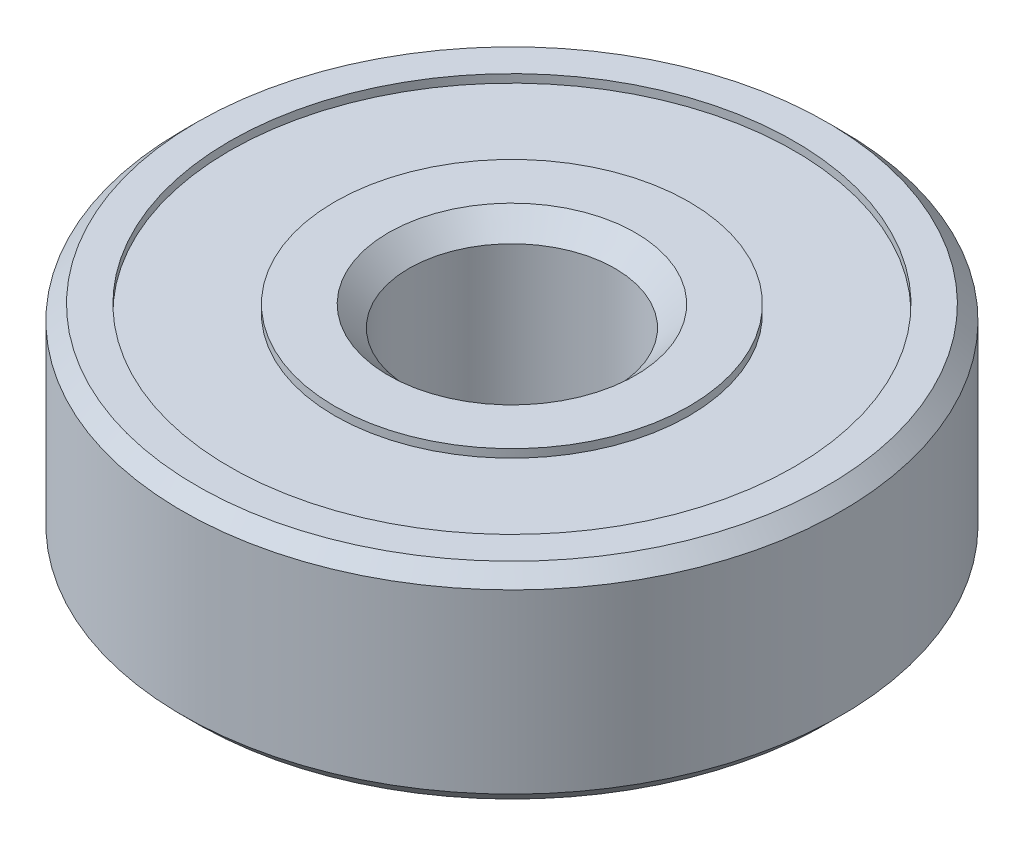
ISO-10303-21;
HEADER;
FILE_DESCRIPTION(('STEP AP214'),'2;1');
FILE_NAME('part.step','',(''),(''),'','','');
FILE_SCHEMA(('AUTOMOTIVE_DESIGN { 1 0 10303 214 1 1 1 1 }'));
ENDSEC;
DATA;
#1=APPLICATION_CONTEXT('core data for automotive mechanical design processes');
#2=APPLICATION_PROTOCOL_DEFINITION('international standard','automotive_design',2000,#1);
#3=PRODUCT_CONTEXT('',#1,'mechanical');
#4=PRODUCT('Part','Part','',(#3));
#5=PRODUCT_RELATED_PRODUCT_CATEGORY('part','',(#4));
#6=PRODUCT_DEFINITION_FORMATION('','',#4);
#7=PRODUCT_DEFINITION_CONTEXT('part definition',#1,'design');
#8=PRODUCT_DEFINITION('design','',#6,#7);
#9=PRODUCT_DEFINITION_SHAPE('','',#8);
#10=(LENGTH_UNIT() NAMED_UNIT(*) SI_UNIT(.MILLI.,.METRE.));
#11=(NAMED_UNIT(*) PLANE_ANGLE_UNIT() SI_UNIT($,.RADIAN.));
#12=(NAMED_UNIT(*) SI_UNIT($,.STERADIAN.) SOLID_ANGLE_UNIT());
#13=UNCERTAINTY_MEASURE_WITH_UNIT(LENGTH_MEASURE(1.E-05),#10,'distance_accuracy_value','');
#14=(GEOMETRIC_REPRESENTATION_CONTEXT(3) GLOBAL_UNCERTAINTY_ASSIGNED_CONTEXT((#13)) GLOBAL_UNIT_ASSIGNED_CONTEXT((#10,
#11,#12)) REPRESENTATION_CONTEXT('',''));
#15=CARTESIAN_POINT('',(0.,0.,0.));
#16=DIRECTION('',(0.,0.,1.));
#17=DIRECTION('',(1.,0.,0.));
#18=AXIS2_PLACEMENT_3D('',#15,#16,#17);
#19=CARTESIAN_POINT('',(0.,-2.32325,0.));
#20=DIRECTION('',(0.,1.,0.));
#21=DIRECTION('',(-1.,0.,0.));
#22=AXIS2_PLACEMENT_3D('',#19,#20,#21);
#23=CONICAL_SURFACE('',#22,7.82325,0.785398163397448);
#24=CARTESIAN_POINT('',(0.,-2.5,0.));
#25=DIRECTION('',(0.,1.,0.));
#26=DIRECTION('',(-1.,0.,0.));
#27=AXIS2_PLACEMENT_3D('',#24,#25,#26);
#28=CIRCLE('',#27,7.6465);
#29=CARTESIAN_POINT('',(-7.6465,-2.5,0.));
#30=VERTEX_POINT('',#29);
#31=EDGE_CURVE('E11',#30,#30,#28,.T.);
#32=ORIENTED_EDGE('',*,*,#31,.T.);
#33=EDGE_LOOP('',(#32));
#34=FACE_BOUND('',#33,.T.);
#35=CARTESIAN_POINT('',(0.,-2.1465,0.));
#36=DIRECTION('',(0.,1.,0.));
#37=DIRECTION('',(-1.,0.,0.));
#38=AXIS2_PLACEMENT_3D('',#35,#36,#37);
#39=CIRCLE('',#38,8.);
#40=CARTESIAN_POINT('',(-8.,-2.1465,0.));
#41=VERTEX_POINT('',#40);
#42=EDGE_CURVE('E100',#41,#41,#39,.T.);
#43=ORIENTED_EDGE('',*,*,#42,.F.);
#44=EDGE_LOOP('',(#43));
#45=FACE_BOUND('',#44,.T.);
#46=ADVANCED_FACE('F16',(#34,#45),#23,.T.);
#47=CARTESIAN_POINT('',(-7.24825,-2.5,0.));
#48=DIRECTION('',(0.,-1.,0.));
#49=DIRECTION('',(0.707106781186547,0.,0.707106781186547));
#50=AXIS2_PLACEMENT_3D('',#47,#48,#49);
#51=PLANE('',#50);
#52=CARTESIAN_POINT('',(0.,-2.5,0.));
#53=DIRECTION('',(0.,1.,0.));
#54=DIRECTION('',(-1.,0.,0.));
#55=AXIS2_PLACEMENT_3D('',#52,#53,#54);
#56=CIRCLE('',#55,6.85);
#57=CARTESIAN_POINT('',(-6.85,-2.5,0.));
#58=VERTEX_POINT('',#57);
#59=EDGE_CURVE('E26',#58,#58,#56,.T.);
#60=ORIENTED_EDGE('',*,*,#59,.T.);
#61=EDGE_LOOP('',(#60));
#62=FACE_BOUND('',#61,.T.);
#63=ORIENTED_EDGE('',*,*,#31,.F.);
#64=EDGE_LOOP('',(#63));
#65=FACE_BOUND('',#64,.T.);
#66=ADVANCED_FACE('F124',(#62,#65),#51,.T.);
#67=CARTESIAN_POINT('',(0.,-2.4,0.));
#68=DIRECTION('',(0.,-1.,0.));
#69=DIRECTION('',(-1.,0.,0.));
#70=AXIS2_PLACEMENT_3D('',#67,#68,#69);
#71=CYLINDRICAL_SURFACE('',#70,6.85);
#72=CARTESIAN_POINT('',(0.,-2.3,0.));
#73=DIRECTION('',(0.,1.,0.));
#74=DIRECTION('',(-1.,0.,0.));
#75=AXIS2_PLACEMENT_3D('',#72,#73,#74);
#76=CIRCLE('',#75,6.85);
#77=CARTESIAN_POINT('',(-6.85,-2.3,0.));
#78=VERTEX_POINT('',#77);
#79=EDGE_CURVE('E113',#78,#78,#76,.T.);
#80=ORIENTED_EDGE('',*,*,#79,.T.);
#81=EDGE_LOOP('',(#80));
#82=FACE_BOUND('',#81,.T.);
#83=ORIENTED_EDGE('',*,*,#59,.F.);
#84=EDGE_LOOP('',(#83));
#85=FACE_BOUND('',#84,.T.);
#86=ADVANCED_FACE('F131',(#82,#85),#71,.F.);
#87=CARTESIAN_POINT('',(-5.575,-2.3,0.));
#88=DIRECTION('',(0.,-1.,0.));
#89=DIRECTION('',(0.707106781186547,0.,0.707106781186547));
#90=AXIS2_PLACEMENT_3D('',#87,#88,#89);
#91=PLANE('',#90);
#92=CARTESIAN_POINT('',(0.,-2.3,0.));
#93=DIRECTION('',(0.,1.,0.));
#94=DIRECTION('',(-1.,0.,0.));
#95=AXIS2_PLACEMENT_3D('',#92,#93,#94);
#96=CIRCLE('',#95,4.3);
#97=CARTESIAN_POINT('',(-4.3,-2.3,0.));
#98=VERTEX_POINT('',#97);
#99=EDGE_CURVE('E110',#98,#98,#96,.T.);
#100=ORIENTED_EDGE('',*,*,#99,.T.);
#101=EDGE_LOOP('',(#100));
#102=FACE_BOUND('',#101,.T.);
#103=ORIENTED_EDGE('',*,*,#79,.F.);
#104=EDGE_LOOP('',(#103));
#105=FACE_BOUND('',#104,.T.);
#106=ADVANCED_FACE('F137',(#102,#105),#91,.T.);
#107=CARTESIAN_POINT('',(0.,-2.4,0.));
#108=DIRECTION('',(0.,1.,0.));
#109=DIRECTION('',(-1.,0.,0.));
#110=AXIS2_PLACEMENT_3D('',#107,#108,#109);
#111=CYLINDRICAL_SURFACE('',#110,4.3);
#112=CARTESIAN_POINT('',(0.,-2.5,0.));
#113=DIRECTION('',(0.,1.,0.));
#114=DIRECTION('',(-1.,0.,0.));
#115=AXIS2_PLACEMENT_3D('',#112,#113,#114);
#116=CIRCLE('',#115,4.3);
#117=CARTESIAN_POINT('',(-4.3,-2.5,0.));
#118=VERTEX_POINT('',#117);
#119=EDGE_CURVE('E107',#118,#118,#116,.T.);
#120=ORIENTED_EDGE('',*,*,#119,.T.);
#121=EDGE_LOOP('',(#120));
#122=FACE_BOUND('',#121,.T.);
#123=ORIENTED_EDGE('',*,*,#99,.F.);
#124=EDGE_LOOP('',(#123));
#125=FACE_BOUND('',#124,.T.);
#126=ADVANCED_FACE('F141',(#122,#125),#111,.T.);
#127=CARTESIAN_POINT('',(-3.65,-2.5,0.));
#128=DIRECTION('',(0.,-1.,0.));
#129=DIRECTION('',(0.707106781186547,0.,0.707106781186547));
#130=AXIS2_PLACEMENT_3D('',#127,#128,#129);
#131=PLANE('',#130);
#132=CARTESIAN_POINT('',(0.,-2.5,0.));
#133=DIRECTION('',(0.,1.,0.));
#134=DIRECTION('',(-1.,0.,0.));
#135=AXIS2_PLACEMENT_3D('',#132,#133,#134);
#136=CIRCLE('',#135,3.);
#137=CARTESIAN_POINT('',(-3.,-2.5,0.));
#138=VERTEX_POINT('',#137);
#139=EDGE_CURVE('E104',#138,#138,#136,.T.);
#140=ORIENTED_EDGE('',*,*,#139,.T.);
#141=EDGE_LOOP('',(#140));
#142=FACE_BOUND('',#141,.T.);
#143=ORIENTED_EDGE('',*,*,#119,.F.);
#144=EDGE_LOOP('',(#143));
#145=FACE_BOUND('',#144,.T.);
#146=ADVANCED_FACE('F145',(#142,#145),#131,.T.);
#147=CARTESIAN_POINT('',(0.,-2.25,0.));
#148=DIRECTION('',(0.,-1.,0.));
#149=DIRECTION('',(-1.,0.,0.));
#150=AXIS2_PLACEMENT_3D('',#147,#148,#149);
#151=CONICAL_SURFACE('',#150,2.75,0.785398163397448);
#152=CARTESIAN_POINT('',(0.,-2.,0.));
#153=DIRECTION('',(0.,1.,0.));
#154=DIRECTION('',(-1.,0.,0.));
#155=AXIS2_PLACEMENT_3D('',#152,#153,#154);
#156=CIRCLE('',#155,2.5);
#157=CARTESIAN_POINT('',(-2.5,-2.,0.));
#158=VERTEX_POINT('',#157);
#159=EDGE_CURVE('E101',#158,#158,#156,.T.);
#160=ORIENTED_EDGE('',*,*,#159,.T.);
#161=EDGE_LOOP('',(#160));
#162=FACE_BOUND('',#161,.T.);
#163=ORIENTED_EDGE('',*,*,#139,.F.);
#164=EDGE_LOOP('',(#163));
#165=FACE_BOUND('',#164,.T.);
#166=ADVANCED_FACE('F149',(#162,#165),#151,.F.);
#167=CARTESIAN_POINT('',(0.,1.07325,0.));
#168=DIRECTION('',(0.,1.,0.));
#169=DIRECTION('',(-1.,0.,0.));
#170=AXIS2_PLACEMENT_3D('',#167,#168,#169);
#171=CYLINDRICAL_SURFACE('',#170,8.);
#172=ORIENTED_EDGE('',*,*,#42,.T.);
#173=EDGE_LOOP('',(#172));
#174=FACE_BOUND('',#173,.T.);
#175=CARTESIAN_POINT('',(0.,2.1465,0.));
#176=DIRECTION('',(0.,1.,0.));
#177=DIRECTION('',(-1.,0.,0.));
#178=AXIS2_PLACEMENT_3D('',#175,#176,#177);
#179=CIRCLE('',#178,8.);
#180=CARTESIAN_POINT('',(-8.,2.1465,0.));
#181=VERTEX_POINT('',#180);
#182=EDGE_CURVE('E97',#181,#181,#179,.T.);
#183=ORIENTED_EDGE('',*,*,#182,.F.);
#184=EDGE_LOOP('',(#183));
#185=FACE_BOUND('',#184,.T.);
#186=ADVANCED_FACE('F120',(#174,#185),#171,.T.);
#187=CARTESIAN_POINT('',(0.,2.32325,0.));
#188=DIRECTION('',(0.,-1.,0.));
#189=DIRECTION('',(-1.,0.,0.));
#190=AXIS2_PLACEMENT_3D('',#187,#188,#189);
#191=CONICAL_SURFACE('',#190,7.82325,0.785398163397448);
#192=CARTESIAN_POINT('',(0.,2.5,0.));
#193=DIRECTION('',(0.,1.,0.));
#194=DIRECTION('',(-1.,0.,0.));
#195=AXIS2_PLACEMENT_3D('',#192,#193,#194);
#196=CIRCLE('',#195,7.6465);
#197=CARTESIAN_POINT('',(-7.6465,2.5,0.));
#198=VERTEX_POINT('',#197);
#199=EDGE_CURVE('E94',#198,#198,#196,.T.);
#200=ORIENTED_EDGE('',*,*,#199,.F.);
#201=EDGE_LOOP('',(#200));
#202=FACE_BOUND('',#201,.T.);
#203=ORIENTED_EDGE('',*,*,#182,.T.);
#204=EDGE_LOOP('',(#203));
#205=FACE_BOUND('',#204,.T.);
#206=ADVANCED_FACE('F156',(#202,#205),#191,.T.);
#207=CARTESIAN_POINT('',(-7.24825,2.5,0.));
#208=DIRECTION('',(0.,1.,0.));
#209=DIRECTION('',(0.707106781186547,0.,0.707106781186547));
#210=AXIS2_PLACEMENT_3D('',#207,#208,#209);
#211=PLANE('',#210);
#212=CARTESIAN_POINT('',(0.,2.5,0.));
#213=DIRECTION('',(0.,1.,0.));
#214=DIRECTION('',(-1.,0.,0.));
#215=AXIS2_PLACEMENT_3D('',#212,#213,#214);
#216=CIRCLE('',#215,6.85);
#217=CARTESIAN_POINT('',(-6.85,2.5,0.));
#218=VERTEX_POINT('',#217);
#219=EDGE_CURVE('E91',#218,#218,#216,.T.);
#220=ORIENTED_EDGE('',*,*,#219,.F.);
#221=EDGE_LOOP('',(#220));
#222=FACE_BOUND('',#221,.T.);
#223=ORIENTED_EDGE('',*,*,#199,.T.);
#224=EDGE_LOOP('',(#223));
#225=FACE_BOUND('',#224,.T.);
#226=ADVANCED_FACE('F159',(#222,#225),#211,.T.);
#227=CARTESIAN_POINT('',(0.,2.4,0.));
#228=DIRECTION('',(0.,-1.,0.));
#229=DIRECTION('',(-1.,0.,0.));
#230=AXIS2_PLACEMENT_3D('',#227,#228,#229);
#231=CYLINDRICAL_SURFACE('',#230,6.85);
#232=CARTESIAN_POINT('',(0.,2.3,0.));
#233=DIRECTION('',(0.,1.,0.));
#234=DIRECTION('',(-1.,0.,0.));
#235=AXIS2_PLACEMENT_3D('',#232,#233,#234);
#236=CIRCLE('',#235,6.85);
#237=CARTESIAN_POINT('',(-6.85,2.3,0.));
#238=VERTEX_POINT('',#237);
#239=EDGE_CURVE('E88',#238,#238,#236,.T.);
#240=ORIENTED_EDGE('',*,*,#239,.F.);
#241=EDGE_LOOP('',(#240));
#242=FACE_BOUND('',#241,.T.);
#243=ORIENTED_EDGE('',*,*,#219,.T.);
#244=EDGE_LOOP('',(#243));
#245=FACE_BOUND('',#244,.T.);
#246=ADVANCED_FACE('F163',(#242,#245),#231,.F.);
#247=CARTESIAN_POINT('',(-5.575,2.3,0.));
#248=DIRECTION('',(0.,1.,0.));
#249=DIRECTION('',(0.707106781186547,0.,0.707106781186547));
#250=AXIS2_PLACEMENT_3D('',#247,#248,#249);
#251=PLANE('',#250);
#252=CARTESIAN_POINT('',(0.,2.3,0.));
#253=DIRECTION('',(0.,1.,0.));
#254=DIRECTION('',(-1.,0.,0.));
#255=AXIS2_PLACEMENT_3D('',#252,#253,#254);
#256=CIRCLE('',#255,4.3);
#257=CARTESIAN_POINT('',(-4.3,2.3,0.));
#258=VERTEX_POINT('',#257);
#259=EDGE_CURVE('E83',#258,#258,#256,.T.);
#260=ORIENTED_EDGE('',*,*,#259,.F.);
#261=EDGE_LOOP('',(#260));
#262=FACE_BOUND('',#261,.T.);
#263=ORIENTED_EDGE('',*,*,#239,.T.);
#264=EDGE_LOOP('',(#263));
#265=FACE_BOUND('',#264,.T.);
#266=ADVANCED_FACE('F167',(#262,#265),#251,.T.);
#267=CARTESIAN_POINT('',(0.,2.4,0.));
#268=DIRECTION('',(0.,1.,0.));
#269=DIRECTION('',(-1.,0.,0.));
#270=AXIS2_PLACEMENT_3D('',#267,#268,#269);
#271=CYLINDRICAL_SURFACE('',#270,4.3);
#272=CARTESIAN_POINT('',(0.,2.5,0.));
#273=DIRECTION('',(0.,1.,0.));
#274=DIRECTION('',(-1.,0.,0.));
#275=AXIS2_PLACEMENT_3D('',#272,#273,#274);
#276=CIRCLE('',#275,4.3);
#277=CARTESIAN_POINT('',(-4.3,2.5,0.));
#278=VERTEX_POINT('',#277);
#279=EDGE_CURVE('E81',#278,#278,#276,.T.);
#280=ORIENTED_EDGE('',*,*,#279,.F.);
#281=EDGE_LOOP('',(#280));
#282=FACE_BOUND('',#281,.T.);
#283=ORIENTED_EDGE('',*,*,#259,.T.);
#284=EDGE_LOOP('',(#283));
#285=FACE_BOUND('',#284,.T.);
#286=ADVANCED_FACE('F171',(#282,#285),#271,.T.);
#287=CARTESIAN_POINT('',(-3.65,2.5,0.));
#288=DIRECTION('',(0.,1.,0.));
#289=DIRECTION('',(0.707106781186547,0.,0.707106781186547));
#290=AXIS2_PLACEMENT_3D('',#287,#288,#289);
#291=PLANE('',#290);
#292=CARTESIAN_POINT('',(0.,2.5,0.));
#293=DIRECTION('',(0.,1.,0.));
#294=DIRECTION('',(-1.,0.,0.));
#295=AXIS2_PLACEMENT_3D('',#292,#293,#294);
#296=CIRCLE('',#295,3.);
#297=CARTESIAN_POINT('',(-3.,2.5,0.));
#298=VERTEX_POINT('',#297);
#299=EDGE_CURVE('E74',#298,#298,#296,.T.);
#300=ORIENTED_EDGE('',*,*,#299,.F.);
#301=EDGE_LOOP('',(#300));
#302=FACE_BOUND('',#301,.T.);
#303=ORIENTED_EDGE('',*,*,#279,.T.);
#304=EDGE_LOOP('',(#303));
#305=FACE_BOUND('',#304,.T.);
#306=ADVANCED_FACE('F175',(#302,#305),#291,.T.);
#307=CARTESIAN_POINT('',(0.,2.25,0.));
#308=DIRECTION('',(0.,1.,0.));
#309=DIRECTION('',(-1.,0.,0.));
#310=AXIS2_PLACEMENT_3D('',#307,#308,#309);
#311=CONICAL_SURFACE('',#310,2.75,0.785398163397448);
#312=CARTESIAN_POINT('',(0.,2.,0.));
#313=DIRECTION('',(0.,1.,0.));
#314=DIRECTION('',(-1.,0.,0.));
#315=AXIS2_PLACEMENT_3D('',#312,#313,#314);
#316=CIRCLE('',#315,2.5);
#317=CARTESIAN_POINT('',(-2.5,2.,0.));
#318=VERTEX_POINT('',#317);
#319=EDGE_CURVE('E20',#318,#318,#316,.T.);
#320=ORIENTED_EDGE('',*,*,#319,.F.);
#321=EDGE_LOOP('',(#320));
#322=FACE_BOUND('',#321,.T.);
#323=ORIENTED_EDGE('',*,*,#299,.T.);
#324=EDGE_LOOP('',(#323));
#325=FACE_BOUND('',#324,.T.);
#326=ADVANCED_FACE('F78',(#322,#325),#311,.F.);
#327=CARTESIAN_POINT('',(0.,1.,0.));
#328=DIRECTION('',(0.,-1.,0.));
#329=DIRECTION('',(-1.,0.,0.));
#330=AXIS2_PLACEMENT_3D('',#327,#328,#329);
#331=CYLINDRICAL_SURFACE('',#330,2.5);
#332=ORIENTED_EDGE('',*,*,#159,.F.);
#333=EDGE_LOOP('',(#332));
#334=FACE_BOUND('',#333,.T.);
#335=ORIENTED_EDGE('',*,*,#319,.T.);
#336=EDGE_LOOP('',(#335));
#337=FACE_BOUND('',#336,.T.);
#338=ADVANCED_FACE('F18',(#334,#337),#331,.F.);
#339=CLOSED_SHELL('',(#46,#66,#86,#106,#126,#146,#166,#186,#206,#226,#246,#266,#286,#306,#326,#338));
#340=MANIFOLD_SOLID_BREP('B1',#339);
#341=ADVANCED_BREP_SHAPE_REPRESENTATION('',(#18,#340),#14);
#342=SHAPE_DEFINITION_REPRESENTATION(#9,#341);
ENDSEC;
END-ISO-10303-21;
